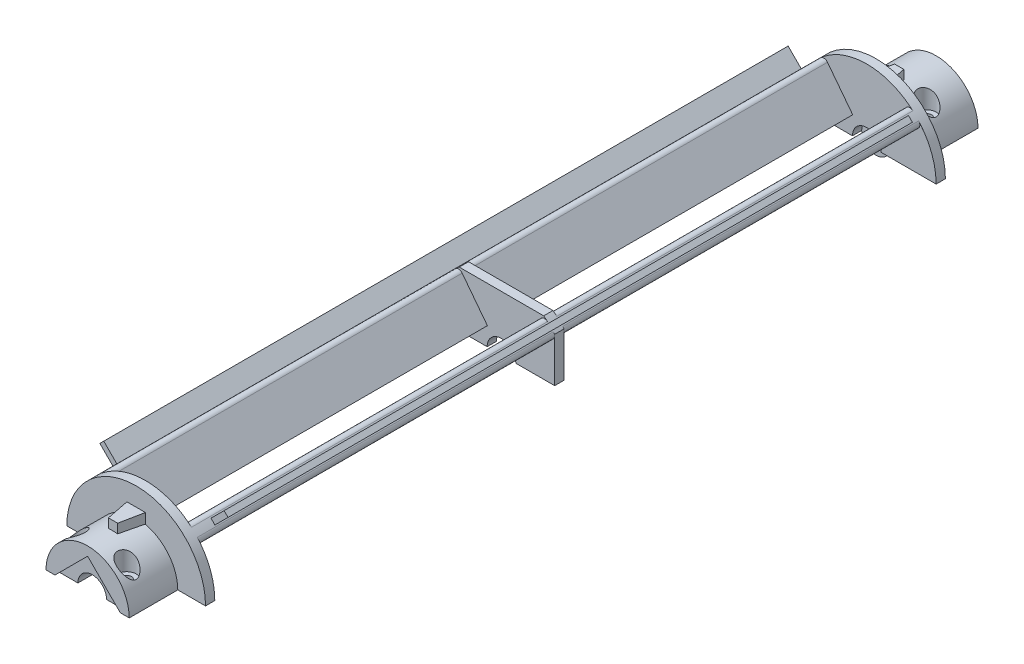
from build123d import *
from build123d.topology import SkipClean

# Parameters (mm, degrees)
FLASQUE_CENTRAL_DEPTH     = 1
BARRE_START               = 80
BARRE_DEPTH               = 158
BOUT_START                = 10.5
BOUT_AVANT_DEPTH          = 10.5
ESQUISSE4_R               = 2
LAMAGE_VIS_DEPTH          = 92.569180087
ESQUISSE5_R               = 1
PASSAGE_VIS_DEPTH         = 92.569180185
LOGEMENT_CARR_DEPTH       = 1
ESQUISSE8_W               = 11.9
ESQUISSE8_H               = 2
FLASQUE_ARRI_RE_ANGLE     = 180
ESQUISSE9_R               = 1.5
EXTRUSION2_DEPTH          = 13
ESQUISSE10_R              = 7.5
LAMAGE_ARRI_RE_DEPTH      = 4.5
SYM_TRIE1_COPY_1_SKETCH_R = 2
SYM_TRIE1_COPY_1_DEPTH    = 92.569180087
SYM_TRIE1_COPY_2_SKETCH_R = 1
SYM_TRIE1_COPY_2_DEPTH    = 92.569180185
EXTRUSION3_DEPTH          = 2
EXTRUSION4_REACH          = 97.251
EXTRUSION4_END_RADIUS     = 9.05
EXTRUSION5_DEPTH          = 148


with BuildPart() as part:
    # Esquisse1 → Flasque central (new, symmetric)
    with BuildSketch(Plane.XY):
        with BuildLine():
            Line((3.1, 0), (11.5, 0))
            Line((11.5, 0), (11.5, 9.630680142))
            ThreePointArc((11.5, 9.630680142), (10.377942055, 10.830434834), (9.131421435, 11.900300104))
            Line((9.131421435, 11.900300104), (-9.131421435, 11.900300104))
            ThreePointArc((-9.131421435, 11.900300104), (-10.377942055, 10.830434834), (-11.5, 9.630680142))
            Line((-11.5, 9.630680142), (-11.5, 0))
            Line((-11.5, 0), (-3.1, 0))
            ThreePointArc((-3.1, 0), (0, 3.1), (3.1, 0))
        make_face()
    extrude(amount=FLASQUE_CENTRAL_DEPTH, both=True)

    # Esquisse2 → Barre (add)
    with BuildSketch(Plane.XY.offset(BARRE_START)):
        with BuildLine():
            Line((3.966766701, 3.043807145), (11.078576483, 8.500890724))
            ThreePointArc((11.078576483, 8.500890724), (11.465291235, 9.199232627), (11.217658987, 9.95811864))
            ThreePointArc((11.217658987, 9.95811864), (10.606601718, 10.606601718), (9.95811864, 11.217658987))
            ThreePointArc((9.95811864, 11.217658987), (9.199232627, 11.465291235), (8.500890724, 11.078576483))
            Line((8.500890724, 11.078576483), (3.043807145, 3.966766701))
            ThreePointArc((3.043807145, 3.966766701), (3.535533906, 3.535533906), (3.966766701, 3.043807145))
        make_face()
    barre = extrude(amount=-BARRE_DEPTH)

    # Sym_trie barre: Barre across plane
    with SkipClean():  # the faces are left unmerged after this step: merging them gives an invalid solid
        add(barre.mirror(Plane(origin=(0, 0, 0), x_dir=(0, 0, 1), z_dir=(1, 0, 0))))

    # Esquisse3 → Bout avant (add)
    with SkipClean():  # the faces are left unmerged after this step: merging them gives an invalid solid
        with BuildSketch(Plane.XY.offset(80).offset(BOUT_START)):
            with BuildLine():
                Line((9, 0), (3.1, 0))
                ThreePointArc((3.1, 0), (0, 3.1), (-3.1, 0))
                Line((-3.1, 0), (-9, 0))
                ThreePointArc((-9, 0), (0, 9), (9, 0))
            make_face()
        extrude(amount=-BOUT_AVANT_DEPTH)

    # Esquisse4 → Lamage vis (cut, through all)
    with SkipClean():  # the faces are left unmerged after this step: merging them gives an invalid solid
        with BuildSketch(Plane(origin=(0, 4, 0), x_dir=(-1, 0, 0), z_dir=(0, 1, 0))):
            with Locations(Location((-5.5, 87.5, 0), (0, 0, 270))):
                Circle(ESQUISSE4_R)
        lamage_vis = extrude(amount=LAMAGE_VIS_DEPTH, mode=Mode.SUBTRACT)

    # Esquisse5 → Passage vis (cut, through all)
    with SkipClean():  # the faces are left unmerged after this step: merging them gives an invalid solid
        with BuildSketch(Plane(origin=(0, 4, 0), x_dir=(-1, 0, 0), z_dir=(0, 1, 0))):
            with Locations(Location((-5.5, 87.5, 0), (0, 0, 90))):
                Circle(ESQUISSE5_R)
        passage_vis = extrude(amount=-PASSAGE_VIS_DEPTH, mode=Mode.SUBTRACT)

    # Sym_trie passage vis: Lamage vis, Passage vis across plane
    with SkipClean():  # the faces are left unmerged after this step: merging them gives an invalid solid
        add(lamage_vis.mirror(Plane(origin=(0, 0, 0), x_dir=(0, 0, 1), z_dir=(1, 0, 0))), mode=Mode.SUBTRACT)
        add(passage_vis.mirror(Plane(origin=(0, 0, 0), x_dir=(0, 0, 1), z_dir=(1, 0, 0))), mode=Mode.SUBTRACT)

    # Esquisse6 → Logement carr (cut)
    with SkipClean():  # the faces are left unmerged after this step: merging them gives an invalid solid
        with BuildSketch(Plane.XY.offset(90.5)):
            Polygon((0, 7.071067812), (7.071067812, 0), (-7.071067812, 0), align=None)
        extrude(amount=-LOGEMENT_CARR_DEPTH, mode=Mode.SUBTRACT)

    # Esquisse8 → Flasque arri_re (revolve)
    with BuildSketch(Plane(origin=(0, 0, 0), x_dir=(1, 0, 0), z_dir=(0, 1, 0))):
        with Locations((9.05, 79)):
            Rectangle(ESQUISSE8_W, ESQUISSE8_H)
    revolve(axis=Axis((0, 0, 0), (0, 0, 1)), revolution_arc=FLASQUE_ARRI_RE_ANGLE)

    # Esquisse9 → Extrusion2 (add)
    with BuildSketch(Plane(origin=(0, 0, -80), x_dir=(-1, 0, 0), z_dir=(0, 0, -1))):
        with BuildLine():
            Line((9.05, 0), (3.1, 0))
            ThreePointArc((3.1, 0), (0, -3.1), (-3.1, 0))
            Line((-3.1, 0), (-9.05, 0))
            ThreePointArc((-9.05, 0), (0, 9.05), (9.05, 0))
        make_face()
        with Locations(Location((0, 0, 0), (0, 0, 180))):
            Circle(ESQUISSE9_R, mode=Mode.SUBTRACT)
    extrude(amount=EXTRUSION2_DEPTH)

    # Esquisse10 → Lamage arri_re (cut)
    with BuildSketch(Plane(origin=(0, 0, -93), x_dir=(-1, 0, 0), z_dir=(0, 0, -1))):
        Circle(ESQUISSE10_R)
    extrude(amount=-LAMAGE_ARRI_RE_DEPTH, mode=Mode.SUBTRACT)

    # Sym_trie1: Lamage vis, Passage vis across plane
    add(lamage_vis.mirror(Plane.XY.offset(1)), mode=Mode.SUBTRACT)
    add(passage_vis.mirror(Plane.XY.offset(1)), mode=Mode.SUBTRACT)

    # Sym_trie1 copy 1 sketch → Sym_trie1 copy 1 (cut, through all)
    with BuildSketch(Plane(origin=(0, 4, 2), x_dir=(1, 0, 0), z_dir=(0, 1, 0))):
        with Locations(Location((-5.5, 87.5, 0), (0, 0, 270))):
            Circle(SYM_TRIE1_COPY_1_SKETCH_R)
    extrude(amount=SYM_TRIE1_COPY_1_DEPTH, mode=Mode.SUBTRACT)

    # Sym_trie1 copy 2 sketch → Sym_trie1 copy 2 (cut, through all)
    with BuildSketch(Plane(origin=(0, 4, 2), x_dir=(1, 0, 0), z_dir=(0, 1, 0))):
        with Locations(Location((-5.5, 87.5, 0), (0, 0, 90))):
            Circle(SYM_TRIE1_COPY_2_SKETCH_R)
    extrude(amount=-SYM_TRIE1_COPY_2_DEPTH, mode=Mode.SUBTRACT)

    # Esquisse11 → Extrusion3 (add)
    with BuildSketch(Plane.XY.offset(80)):
        with BuildLine():
            Line((15, 0), (1.5, 0))
            ThreePointArc((1.5, 0), (0, 1.5), (-1.5, 0))
            Line((-1.5, 0), (-15, 0))
            ThreePointArc((-15, 0), (0, 15), (15, 0))
        make_face()
    extrude(amount=-EXTRUSION3_DEPTH)

    # Extrusion4: up to this cylinder (the profile starts outside it)
    extrusion4_end = Plane(origin=(0, 0, 0), z_dir=(0, 0, 1)) * Cylinder(EXTRUSION4_END_RADIUS, 378.046444, mode=Mode.PRIVATE)
    # Esquisse12 → Extrusion4 (add, up to the surface)
    with BuildSketch(Plane.XZ.offset(-11), mode=Mode.PRIVATE) as extrusion4_sk1:
        Polygon((-2, -80), (2, -80), (1, -85), (-1, -85), align=None)
    extrusion4_tool1 = extrude(extrusion4_sk1.sketch, amount=EXTRUSION4_REACH, mode=Mode.PRIVATE) - extrusion4_end
    add(extrusion4_tool1.solids().sort_by_distance((0, 11, -82.222222))[0])
    # Esquisse12 → Extrusion4 (add, up to the surface)
    with BuildSketch(Plane.XZ.offset(-11), mode=Mode.PRIVATE) as extrusion4_sk2:
        Polygon((-1, 85), (1, 85), (2, 80), (-2, 80), align=None)
    extrusion4_tool2 = extrude(extrusion4_sk2.sketch, amount=EXTRUSION4_REACH, mode=Mode.PRIVATE) - extrusion4_end
    add(extrusion4_tool2.solids().sort_by_distance((0, 11, 82.222222))[0])

    # Esquisse13 → Extrusion5 (add)
    with BuildSketch(Plane.XY.offset(-74)):
        Polygon((13.010764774, 13.859292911), (9.75807358, 10.606601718), (10.606601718, 9.75807358), (13.859292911, 13.010764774), align=None)
    extrusion5 = extrude(amount=EXTRUSION5_DEPTH)

    # Sym_trie2: Extrusion5 across plane
    add(extrusion5.mirror(Plane(origin=(0, 0, 0), x_dir=(0, 0, 1), z_dir=(1, 0, 0))))


solid = part.part
